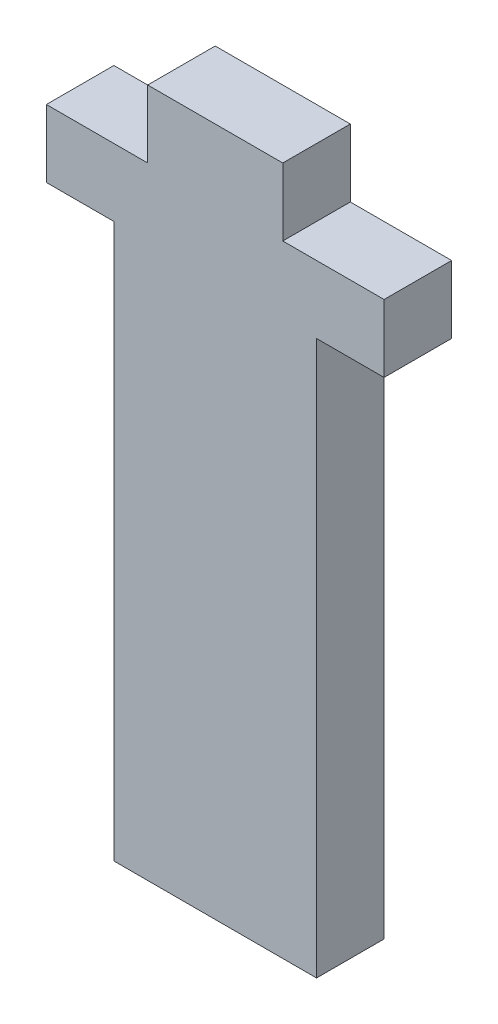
from build123d import *

# Parameters (mm, degrees)
ESQUISSE1_W             = 25
ESQUISSE1_H             = 51
BOSS_EXTRU_1_DEPTH      = 5
ENL_V_MAT_EXTRU_1_REACH = 30.836
ESQUISSE2_W             = 7.5
ESQUISSE2_H             = 5
ENL_V_MAT_EXTRU_2_REACH = 30.836
ESQUISSE3_W             = 5
ESQUISSE3_H             = 41


with BuildPart() as part:
    # Esquisse1 → Boss.-Extru.1 (new body)
    with BuildSketch(Plane.XY):
        Rectangle(ESQUISSE1_W, ESQUISSE1_H)
    extrude(amount=BOSS_EXTRU_1_DEPTH)

    # Esquisse2 → Enl_v. mat.-Extru.1 (cut, up to next)
    with BuildSketch(Plane.XY.offset(5), mode=Mode.PRIVATE) as enl_v_mat_extru_1_sk1:
        with Locations((-8.75, 23)):
            Rectangle(ESQUISSE2_W, ESQUISSE2_H)
    enl_v_mat_extru_1_tool1 = extrude(enl_v_mat_extru_1_sk1.sketch, amount=-ENL_V_MAT_EXTRU_1_REACH, mode=Mode.PRIVATE) & part.part
    # Esquisse2 → Enl_v. mat.-Extru.1 (cut, up to next)
    with BuildSketch(Plane.XY.offset(5), mode=Mode.PRIVATE) as enl_v_mat_extru_1_sk2:
        with Locations((8.75, 23)):
            Rectangle(ESQUISSE2_W, ESQUISSE2_H)
    enl_v_mat_extru_1_tool2 = extrude(enl_v_mat_extru_1_sk2.sketch, amount=-ENL_V_MAT_EXTRU_1_REACH, mode=Mode.PRIVATE) & part.part
    add(enl_v_mat_extru_1_tool1.solids().sort_by_distance((-8.75, 23, 5))[0], mode=Mode.SUBTRACT)
    add(enl_v_mat_extru_1_tool2.solids().sort_by_distance((8.75, 23, 5))[0], mode=Mode.SUBTRACT)

    # Esquisse3 → Enl_v. mat.-Extru.2 (cut, up to next)
    with BuildSketch(Plane.XY.offset(5), mode=Mode.PRIVATE) as enl_v_mat_extru_2_sk1:
        with Locations((-10, -5)):
            Rectangle(ESQUISSE3_W, ESQUISSE3_H)
    enl_v_mat_extru_2_tool1 = extrude(enl_v_mat_extru_2_sk1.sketch, amount=-ENL_V_MAT_EXTRU_2_REACH, mode=Mode.PRIVATE) & part.part
    # Esquisse3 → Enl_v. mat.-Extru.2 (cut, up to next)
    with BuildSketch(Plane.XY.offset(5), mode=Mode.PRIVATE) as enl_v_mat_extru_2_sk2:
        with Locations((10, -5)):
            Rectangle(ESQUISSE3_W, ESQUISSE3_H)
    enl_v_mat_extru_2_tool2 = extrude(enl_v_mat_extru_2_sk2.sketch, amount=-ENL_V_MAT_EXTRU_2_REACH, mode=Mode.PRIVATE) & part.part
    add(enl_v_mat_extru_2_tool1.solids().sort_by_distance((-10, -5, 5))[0], mode=Mode.SUBTRACT)
    add(enl_v_mat_extru_2_tool2.solids().sort_by_distance((10, -5, 5))[0], mode=Mode.SUBTRACT)


solid = part.part
